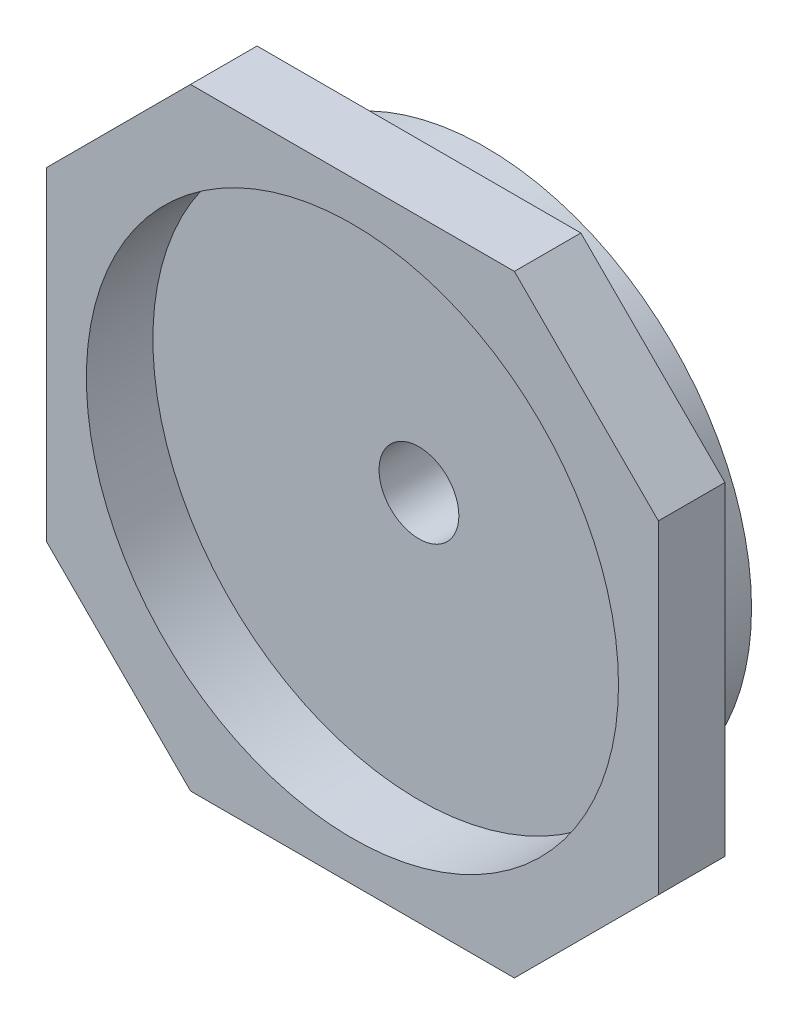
from build123d import *

# Parameters (mm, degrees)
CROQUIS1_R              = 100
CROQUIS1_R_2            = 15
SALIENTE_EXTRUIR1_DEPTH = 25
CROQUIS1_3_R            = 100
SALIENTE_EXTRUIR2_DEPTH = 25


with BuildPart() as part:
    # Croquis1 → Saliente-Extruir1 (new body)
    with BuildSketch(Plane.XY):
        with Locations((112.5, 58.5)):
            Circle(CROQUIS1_R)
        with Locations((112.5, 58.5)):
            Circle(CROQUIS1_R_2, mode=Mode.SUBTRACT)
    extrude(amount=-SALIENTE_EXTRUIR1_DEPTH)


with BuildPart() as body_2:
    # Croquis1_3 → Saliente-Extruir2 (new body)
    with BuildSketch(Plane.XY):
        Polygon((-2.5, 119.357864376), (-2.5, -2.357864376), (51.642135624, -56.5), (173.357864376, -56.5), (227.5, -2.357864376), (227.5, 119.357864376), (173.357864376, 173.5), (51.642135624, 173.5), align=None)
        with Locations((112.5, 58.5)):
            Circle(CROQUIS1_3_R, mode=Mode.SUBTRACT)
    extrude(amount=SALIENTE_EXTRUIR2_DEPTH)


solid = Compound([part.part, body_2.part])
